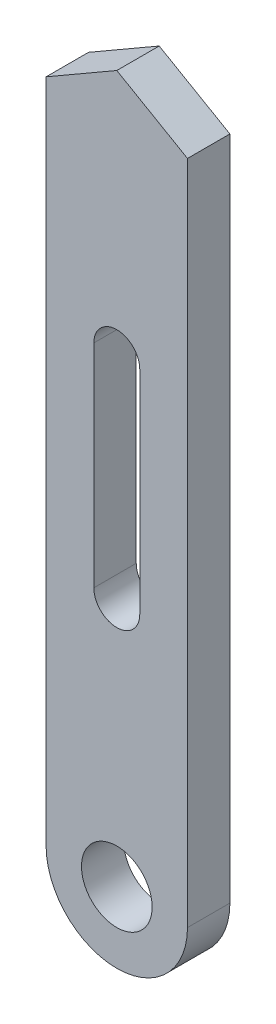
ISO-10303-21;
HEADER;
FILE_DESCRIPTION(('STEP AP214'),'2;1');
FILE_NAME('part.step','',(''),(''),'','','');
FILE_SCHEMA(('AUTOMOTIVE_DESIGN { 1 0 10303 214 1 1 1 1 }'));
ENDSEC;
DATA;
#1=APPLICATION_CONTEXT('core data for automotive mechanical design processes');
#2=APPLICATION_PROTOCOL_DEFINITION('international standard','automotive_design',2000,#1);
#3=PRODUCT_CONTEXT('',#1,'mechanical');
#4=PRODUCT('Part','Part','',(#3));
#5=PRODUCT_RELATED_PRODUCT_CATEGORY('part','',(#4));
#6=PRODUCT_DEFINITION_FORMATION('','',#4);
#7=PRODUCT_DEFINITION_CONTEXT('part definition',#1,'design');
#8=PRODUCT_DEFINITION('design','',#6,#7);
#9=PRODUCT_DEFINITION_SHAPE('','',#8);
#10=(LENGTH_UNIT() NAMED_UNIT(*) SI_UNIT(.MILLI.,.METRE.));
#11=(NAMED_UNIT(*) PLANE_ANGLE_UNIT() SI_UNIT($,.RADIAN.));
#12=(NAMED_UNIT(*) SI_UNIT($,.STERADIAN.) SOLID_ANGLE_UNIT());
#13=UNCERTAINTY_MEASURE_WITH_UNIT(LENGTH_MEASURE(1.E-05),#10,'distance_accuracy_value','');
#14=(GEOMETRIC_REPRESENTATION_CONTEXT(3) GLOBAL_UNCERTAINTY_ASSIGNED_CONTEXT((#13)) GLOBAL_UNIT_ASSIGNED_CONTEXT((#10,
#11,#12)) REPRESENTATION_CONTEXT('',''));
#15=CARTESIAN_POINT('',(0.,0.,0.));
#16=DIRECTION('',(0.,0.,1.));
#17=DIRECTION('',(1.,0.,0.));
#18=AXIS2_PLACEMENT_3D('',#15,#16,#17);
#19=CARTESIAN_POINT('',(0.,0.,6.));
#20=DIRECTION('',(0.,0.,1.));
#21=DIRECTION('',(1.,0.,0.));
#22=AXIS2_PLACEMENT_3D('',#19,#20,#21);
#23=PLANE('',#22);
#24=CARTESIAN_POINT('',(0.,0.,6.));
#25=DIRECTION('',(0.,0.,1.));
#26=DIRECTION('',(1.,0.,0.));
#27=AXIS2_PLACEMENT_3D('',#24,#25,#26);
#28=CIRCLE('',#27,5.);
#29=CARTESIAN_POINT('',(5.,0.,6.));
#30=VERTEX_POINT('',#29);
#31=EDGE_CURVE('E138',#30,#30,#28,.T.);
#32=ORIENTED_EDGE('',*,*,#31,.F.);
#33=EDGE_LOOP('',(#32));
#34=FACE_BOUND('',#33,.T.);
#35=CARTESIAN_POINT('',(0.,0.,6.));
#36=DIRECTION('',(0.,0.,1.));
#37=DIRECTION('',(1.,0.,0.));
#38=AXIS2_PLACEMENT_3D('',#35,#36,#37);
#39=CIRCLE('',#38,10.);
#40=CARTESIAN_POINT('',(-10.,0.,6.));
#41=VERTEX_POINT('',#40);
#42=CARTESIAN_POINT('',(10.,0.,6.));
#43=VERTEX_POINT('',#42);
#44=EDGE_CURVE('E144',#41,#43,#39,.T.);
#45=ORIENTED_EDGE('',*,*,#44,.T.);
#46=DIRECTION('',(0.,1.,0.));
#47=VECTOR('',#46,1.);
#48=CARTESIAN_POINT('',(10.,0.,6.));
#49=LINE('',#48,#47);
#50=CARTESIAN_POINT('',(10.,94.2264973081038,6.));
#51=VERTEX_POINT('',#50);
#52=EDGE_CURVE('E147',#43,#51,#49,.T.);
#53=ORIENTED_EDGE('',*,*,#52,.T.);
#54=DIRECTION('',(-0.86602540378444,0.499999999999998,0.));
#55=VECTOR('',#54,1.);
#56=CARTESIAN_POINT('',(10.,94.2264973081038,6.));
#57=LINE('',#56,#55);
#58=CARTESIAN_POINT('',(0.,100.,6.));
#59=VERTEX_POINT('',#58);
#60=EDGE_CURVE('E150',#51,#59,#57,.T.);
#61=ORIENTED_EDGE('',*,*,#60,.T.);
#62=DIRECTION('',(-0.866025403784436,-0.500000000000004,0.));
#63=VECTOR('',#62,1.);
#64=CARTESIAN_POINT('',(0.,100.,6.));
#65=LINE('',#64,#63);
#66=CARTESIAN_POINT('',(-10.,94.2264973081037,6.));
#67=VERTEX_POINT('',#66);
#68=EDGE_CURVE('E152',#59,#67,#65,.T.);
#69=ORIENTED_EDGE('',*,*,#68,.T.);
#70=DIRECTION('',(0.,-1.,0.));
#71=VECTOR('',#70,1.);
#72=CARTESIAN_POINT('',(-10.,0.,6.));
#73=LINE('',#72,#71);
#74=EDGE_CURVE('E154',#67,#41,#73,.T.);
#75=ORIENTED_EDGE('',*,*,#74,.T.);
#76=EDGE_LOOP('',(#45,#53,#61,#69,#75));
#77=FACE_BOUND('',#76,.T.);
#78=DIRECTION('',(0.,-1.,0.));
#79=VECTOR('',#78,1.);
#80=CARTESIAN_POINT('',(-3.25,65.,6.));
#81=LINE('',#80,#79);
#82=CARTESIAN_POINT('',(-3.25,65.,6.));
#83=VERTEX_POINT('',#82);
#84=CARTESIAN_POINT('',(-3.25,35.,6.));
#85=VERTEX_POINT('',#84);
#86=EDGE_CURVE('E110',#83,#85,#81,.T.);
#87=ORIENTED_EDGE('',*,*,#86,.F.);
#88=CARTESIAN_POINT('',(0.,65.,6.));
#89=DIRECTION('',(0.,0.,1.));
#90=DIRECTION('',(1.,0.,0.));
#91=AXIS2_PLACEMENT_3D('',#88,#89,#90);
#92=CIRCLE('',#91,3.25);
#93=CARTESIAN_POINT('',(3.25,65.,6.));
#94=VERTEX_POINT('',#93);
#95=EDGE_CURVE('E102',#94,#83,#92,.T.);
#96=ORIENTED_EDGE('',*,*,#95,.F.);
#97=DIRECTION('',(0.,1.,0.));
#98=VECTOR('',#97,1.);
#99=CARTESIAN_POINT('',(3.25,65.,6.));
#100=LINE('',#99,#98);
#101=CARTESIAN_POINT('',(3.25,35.,6.));
#102=VERTEX_POINT('',#101);
#103=EDGE_CURVE('E124',#102,#94,#100,.T.);
#104=ORIENTED_EDGE('',*,*,#103,.F.);
#105=CARTESIAN_POINT('',(0.,35.,6.));
#106=DIRECTION('',(0.,0.,1.));
#107=DIRECTION('',(1.,0.,0.));
#108=AXIS2_PLACEMENT_3D('',#105,#106,#107);
#109=CIRCLE('',#108,3.25);
#110=EDGE_CURVE('E122',#85,#102,#109,.T.);
#111=ORIENTED_EDGE('',*,*,#110,.F.);
#112=EDGE_LOOP('',(#87,#96,#104,#111));
#113=FACE_BOUND('',#112,.T.);
#114=ADVANCED_FACE('F31',(#34,#77,#113),#23,.T.);
#115=CARTESIAN_POINT('',(0.,0.,0.));
#116=DIRECTION('',(0.,0.,1.));
#117=DIRECTION('',(1.,0.,0.));
#118=AXIS2_PLACEMENT_3D('',#115,#116,#117);
#119=PLANE('',#118);
#120=CARTESIAN_POINT('',(0.,0.,0.));
#121=DIRECTION('',(0.,0.,1.));
#122=DIRECTION('',(1.,0.,0.));
#123=AXIS2_PLACEMENT_3D('',#120,#121,#122);
#124=CIRCLE('',#123,5.);
#125=CARTESIAN_POINT('',(5.,0.,0.));
#126=VERTEX_POINT('',#125);
#127=EDGE_CURVE('E118',#126,#126,#124,.T.);
#128=ORIENTED_EDGE('',*,*,#127,.T.);
#129=EDGE_LOOP('',(#128));
#130=FACE_BOUND('',#129,.T.);
#131=CARTESIAN_POINT('',(0.,0.,0.));
#132=DIRECTION('',(0.,0.,1.));
#133=DIRECTION('',(1.,0.,0.));
#134=AXIS2_PLACEMENT_3D('',#131,#132,#133);
#135=CIRCLE('',#134,10.);
#136=CARTESIAN_POINT('',(-10.,0.,0.));
#137=VERTEX_POINT('',#136);
#138=CARTESIAN_POINT('',(10.,0.,0.));
#139=VERTEX_POINT('',#138);
#140=EDGE_CURVE('E141',#137,#139,#135,.T.);
#141=ORIENTED_EDGE('',*,*,#140,.F.);
#142=DIRECTION('',(0.,-1.,0.));
#143=VECTOR('',#142,1.);
#144=CARTESIAN_POINT('',(-10.,0.,0.));
#145=LINE('',#144,#143);
#146=CARTESIAN_POINT('',(-10.,94.2264973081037,0.));
#147=VERTEX_POINT('',#146);
#148=EDGE_CURVE('E148',#147,#137,#145,.T.);
#149=ORIENTED_EDGE('',*,*,#148,.F.);
#150=DIRECTION('',(-0.866025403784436,-0.500000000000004,0.));
#151=VECTOR('',#150,1.);
#152=CARTESIAN_POINT('',(0.,100.,0.));
#153=LINE('',#152,#151);
#154=CARTESIAN_POINT('',(0.,100.,0.));
#155=VERTEX_POINT('',#154);
#156=EDGE_CURVE('E163',#155,#147,#153,.T.);
#157=ORIENTED_EDGE('',*,*,#156,.F.);
#158=DIRECTION('',(-0.86602540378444,0.499999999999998,0.));
#159=VECTOR('',#158,1.);
#160=CARTESIAN_POINT('',(10.,94.2264973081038,0.));
#161=LINE('',#160,#159);
#162=CARTESIAN_POINT('',(10.,94.2264973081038,0.));
#163=VERTEX_POINT('',#162);
#164=EDGE_CURVE('E161',#163,#155,#161,.T.);
#165=ORIENTED_EDGE('',*,*,#164,.F.);
#166=DIRECTION('',(0.,1.,0.));
#167=VECTOR('',#166,1.);
#168=CARTESIAN_POINT('',(10.,0.,0.));
#169=LINE('',#168,#167);
#170=EDGE_CURVE('E159',#139,#163,#169,.T.);
#171=ORIENTED_EDGE('',*,*,#170,.F.);
#172=EDGE_LOOP('',(#141,#149,#157,#165,#171));
#173=FACE_BOUND('',#172,.T.);
#174=CARTESIAN_POINT('',(0.,65.,0.));
#175=DIRECTION('',(0.,0.,1.));
#176=DIRECTION('',(1.,0.,0.));
#177=AXIS2_PLACEMENT_3D('',#174,#175,#176);
#178=CIRCLE('',#177,3.25);
#179=CARTESIAN_POINT('',(3.25,65.,0.));
#180=VERTEX_POINT('',#179);
#181=CARTESIAN_POINT('',(-3.25,65.,0.));
#182=VERTEX_POINT('',#181);
#183=EDGE_CURVE('E54',#180,#182,#178,.T.);
#184=ORIENTED_EDGE('',*,*,#183,.T.);
#185=DIRECTION('',(0.,-1.,0.));
#186=VECTOR('',#185,1.);
#187=CARTESIAN_POINT('',(-3.25,65.,0.));
#188=LINE('',#187,#186);
#189=CARTESIAN_POINT('',(-3.25,35.,0.));
#190=VERTEX_POINT('',#189);
#191=EDGE_CURVE('E117',#182,#190,#188,.T.);
#192=ORIENTED_EDGE('',*,*,#191,.T.);
#193=CARTESIAN_POINT('',(0.,35.,0.));
#194=DIRECTION('',(0.,0.,1.));
#195=DIRECTION('',(1.,0.,0.));
#196=AXIS2_PLACEMENT_3D('',#193,#194,#195);
#197=CIRCLE('',#196,3.25);
#198=CARTESIAN_POINT('',(3.25,35.,0.));
#199=VERTEX_POINT('',#198);
#200=EDGE_CURVE('E130',#190,#199,#197,.T.);
#201=ORIENTED_EDGE('',*,*,#200,.T.);
#202=DIRECTION('',(0.,1.,0.));
#203=VECTOR('',#202,1.);
#204=CARTESIAN_POINT('',(3.25,65.,0.));
#205=LINE('',#204,#203);
#206=EDGE_CURVE('E111',#199,#180,#205,.T.);
#207=ORIENTED_EDGE('',*,*,#206,.T.);
#208=EDGE_LOOP('',(#184,#192,#201,#207));
#209=FACE_BOUND('',#208,.T.);
#210=ADVANCED_FACE('F184',(#130,#173,#209),#119,.F.);
#211=CARTESIAN_POINT('',(0.,0.,6.));
#212=DIRECTION('',(0.,0.,-1.));
#213=DIRECTION('',(-1.,0.,0.));
#214=AXIS2_PLACEMENT_3D('',#211,#212,#213);
#215=CYLINDRICAL_SURFACE('',#214,10.);
#216=ORIENTED_EDGE('',*,*,#140,.T.);
#217=DIRECTION('',(0.,0.,-1.));
#218=VECTOR('',#217,1.);
#219=CARTESIAN_POINT('',(10.,0.,6.));
#220=LINE('',#219,#218);
#221=EDGE_CURVE('E11',#43,#139,#220,.T.);
#222=ORIENTED_EDGE('',*,*,#221,.F.);
#223=ORIENTED_EDGE('',*,*,#44,.F.);
#224=DIRECTION('',(0.,0.,-1.));
#225=VECTOR('',#224,1.);
#226=CARTESIAN_POINT('',(-10.,0.,6.));
#227=LINE('',#226,#225);
#228=EDGE_CURVE('E156',#41,#137,#227,.T.);
#229=ORIENTED_EDGE('',*,*,#228,.T.);
#230=EDGE_LOOP('',(#216,#222,#223,#229));
#231=FACE_BOUND('',#230,.T.);
#232=ADVANCED_FACE('F33',(#231),#215,.T.);
#233=CARTESIAN_POINT('',(10.,0.,6.));
#234=DIRECTION('',(-1.,0.,0.));
#235=DIRECTION('',(0.,0.,1.));
#236=AXIS2_PLACEMENT_3D('',#233,#234,#235);
#237=PLANE('',#236);
#238=ORIENTED_EDGE('',*,*,#170,.T.);
#239=DIRECTION('',(0.,0.,-1.));
#240=VECTOR('',#239,1.);
#241=CARTESIAN_POINT('',(10.,94.2264973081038,6.));
#242=LINE('',#241,#240);
#243=EDGE_CURVE('E39',#51,#163,#242,.T.);
#244=ORIENTED_EDGE('',*,*,#243,.F.);
#245=ORIENTED_EDGE('',*,*,#52,.F.);
#246=ORIENTED_EDGE('',*,*,#221,.T.);
#247=EDGE_LOOP('',(#238,#244,#245,#246));
#248=FACE_BOUND('',#247,.T.);
#249=ADVANCED_FACE('F198',(#248),#237,.F.);
#250=CARTESIAN_POINT('',(10.,94.2264973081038,6.));
#251=DIRECTION('',(-0.499999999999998,-0.86602540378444,0.));
#252=DIRECTION('',(0.86602540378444,-0.499999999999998,0.));
#253=AXIS2_PLACEMENT_3D('',#250,#251,#252);
#254=PLANE('',#253);
#255=ORIENTED_EDGE('',*,*,#164,.T.);
#256=DIRECTION('',(0.,0.,-1.));
#257=VECTOR('',#256,1.);
#258=CARTESIAN_POINT('',(0.,100.,6.));
#259=LINE('',#258,#257);
#260=EDGE_CURVE('E171',#59,#155,#259,.T.);
#261=ORIENTED_EDGE('',*,*,#260,.F.);
#262=ORIENTED_EDGE('',*,*,#60,.F.);
#263=ORIENTED_EDGE('',*,*,#243,.T.);
#264=EDGE_LOOP('',(#255,#261,#262,#263));
#265=FACE_BOUND('',#264,.T.);
#266=ADVANCED_FACE('F178',(#265),#254,.F.);
#267=CARTESIAN_POINT('',(0.,100.,6.));
#268=DIRECTION('',(0.500000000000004,-0.866025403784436,0.));
#269=DIRECTION('',(0.866025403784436,0.500000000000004,0.));
#270=AXIS2_PLACEMENT_3D('',#267,#268,#269);
#271=PLANE('',#270);
#272=ORIENTED_EDGE('',*,*,#156,.T.);
#273=DIRECTION('',(0.,0.,-1.));
#274=VECTOR('',#273,1.);
#275=CARTESIAN_POINT('',(-10.,94.2264973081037,6.));
#276=LINE('',#275,#274);
#277=EDGE_CURVE('E168',#67,#147,#276,.T.);
#278=ORIENTED_EDGE('',*,*,#277,.F.);
#279=ORIENTED_EDGE('',*,*,#68,.F.);
#280=ORIENTED_EDGE('',*,*,#260,.T.);
#281=EDGE_LOOP('',(#272,#278,#279,#280));
#282=FACE_BOUND('',#281,.T.);
#283=ADVANCED_FACE('F189',(#282),#271,.F.);
#284=CARTESIAN_POINT('',(-10.,0.,6.));
#285=DIRECTION('',(1.,0.,0.));
#286=DIRECTION('',(0.,0.,-1.));
#287=AXIS2_PLACEMENT_3D('',#284,#285,#286);
#288=PLANE('',#287);
#289=ORIENTED_EDGE('',*,*,#148,.T.);
#290=ORIENTED_EDGE('',*,*,#228,.F.);
#291=ORIENTED_EDGE('',*,*,#74,.F.);
#292=ORIENTED_EDGE('',*,*,#277,.T.);
#293=EDGE_LOOP('',(#289,#290,#291,#292));
#294=FACE_BOUND('',#293,.T.);
#295=ADVANCED_FACE('F193',(#294),#288,.F.);
#296=CARTESIAN_POINT('',(0.,0.,6.));
#297=DIRECTION('',(0.,0.,-1.));
#298=DIRECTION('',(-1.,0.,0.));
#299=AXIS2_PLACEMENT_3D('',#296,#297,#298);
#300=CYLINDRICAL_SURFACE('',#299,5.);
#301=ORIENTED_EDGE('',*,*,#31,.T.);
#302=EDGE_LOOP('',(#301));
#303=FACE_BOUND('',#302,.T.);
#304=ORIENTED_EDGE('',*,*,#127,.F.);
#305=EDGE_LOOP('',(#304));
#306=FACE_BOUND('',#305,.T.);
#307=ADVANCED_FACE('F214',(#303,#306),#300,.F.);
#308=CARTESIAN_POINT('',(0.,65.,6.));
#309=DIRECTION('',(0.,0.,-1.));
#310=DIRECTION('',(-1.,0.,0.));
#311=AXIS2_PLACEMENT_3D('',#308,#309,#310);
#312=CYLINDRICAL_SURFACE('',#311,3.25);
#313=ORIENTED_EDGE('',*,*,#183,.F.);
#314=DIRECTION('',(0.,0.,-1.));
#315=VECTOR('',#314,1.);
#316=CARTESIAN_POINT('',(3.25,65.,6.));
#317=LINE('',#316,#315);
#318=EDGE_CURVE('E106',#94,#180,#317,.T.);
#319=ORIENTED_EDGE('',*,*,#318,.F.);
#320=ORIENTED_EDGE('',*,*,#95,.T.);
#321=DIRECTION('',(0.,0.,-1.));
#322=VECTOR('',#321,1.);
#323=CARTESIAN_POINT('',(-3.25,65.,6.));
#324=LINE('',#323,#322);
#325=EDGE_CURVE('E105',#83,#182,#324,.T.);
#326=ORIENTED_EDGE('',*,*,#325,.T.);
#327=EDGE_LOOP('',(#313,#319,#320,#326));
#328=FACE_BOUND('',#327,.T.);
#329=ADVANCED_FACE('F104',(#328),#312,.F.);
#330=CARTESIAN_POINT('',(-3.25,65.,6.));
#331=DIRECTION('',(1.,0.,0.));
#332=DIRECTION('',(0.,1.,0.));
#333=AXIS2_PLACEMENT_3D('',#330,#331,#332);
#334=PLANE('',#333);
#335=ORIENTED_EDGE('',*,*,#191,.F.);
#336=ORIENTED_EDGE('',*,*,#325,.F.);
#337=ORIENTED_EDGE('',*,*,#86,.T.);
#338=DIRECTION('',(0.,0.,-1.));
#339=VECTOR('',#338,1.);
#340=CARTESIAN_POINT('',(-3.25,35.,6.));
#341=LINE('',#340,#339);
#342=EDGE_CURVE('E119',#85,#190,#341,.T.);
#343=ORIENTED_EDGE('',*,*,#342,.T.);
#344=EDGE_LOOP('',(#335,#336,#337,#343));
#345=FACE_BOUND('',#344,.T.);
#346=ADVANCED_FACE('F114',(#345),#334,.T.);
#347=CARTESIAN_POINT('',(0.,35.,6.));
#348=DIRECTION('',(0.,0.,-1.));
#349=DIRECTION('',(-1.,0.,0.));
#350=AXIS2_PLACEMENT_3D('',#347,#348,#349);
#351=CYLINDRICAL_SURFACE('',#350,3.25);
#352=ORIENTED_EDGE('',*,*,#200,.F.);
#353=ORIENTED_EDGE('',*,*,#342,.F.);
#354=ORIENTED_EDGE('',*,*,#110,.T.);
#355=DIRECTION('',(0.,0.,-1.));
#356=VECTOR('',#355,1.);
#357=CARTESIAN_POINT('',(3.25,35.,6.));
#358=LINE('',#357,#356);
#359=EDGE_CURVE('E46',#102,#199,#358,.T.);
#360=ORIENTED_EDGE('',*,*,#359,.T.);
#361=EDGE_LOOP('',(#352,#353,#354,#360));
#362=FACE_BOUND('',#361,.T.);
#363=ADVANCED_FACE('F251',(#362),#351,.F.);
#364=CARTESIAN_POINT('',(3.25,65.,6.));
#365=DIRECTION('',(-1.,0.,0.));
#366=DIRECTION('',(0.,-1.,0.));
#367=AXIS2_PLACEMENT_3D('',#364,#365,#366);
#368=PLANE('',#367);
#369=ORIENTED_EDGE('',*,*,#206,.F.);
#370=ORIENTED_EDGE('',*,*,#359,.F.);
#371=ORIENTED_EDGE('',*,*,#103,.T.);
#372=ORIENTED_EDGE('',*,*,#318,.T.);
#373=EDGE_LOOP('',(#369,#370,#371,#372));
#374=FACE_BOUND('',#373,.T.);
#375=ADVANCED_FACE('F258',(#374),#368,.T.);
#376=CLOSED_SHELL('',(#114,#210,#232,#249,#266,#283,#295,#307,#329,#346,#363,#375));
#377=MANIFOLD_SOLID_BREP('B2',#376);
#378=ADVANCED_BREP_SHAPE_REPRESENTATION('',(#18,#377),#14);
#379=SHAPE_DEFINITION_REPRESENTATION(#9,#378);
ENDSEC;
END-ISO-10303-21;
